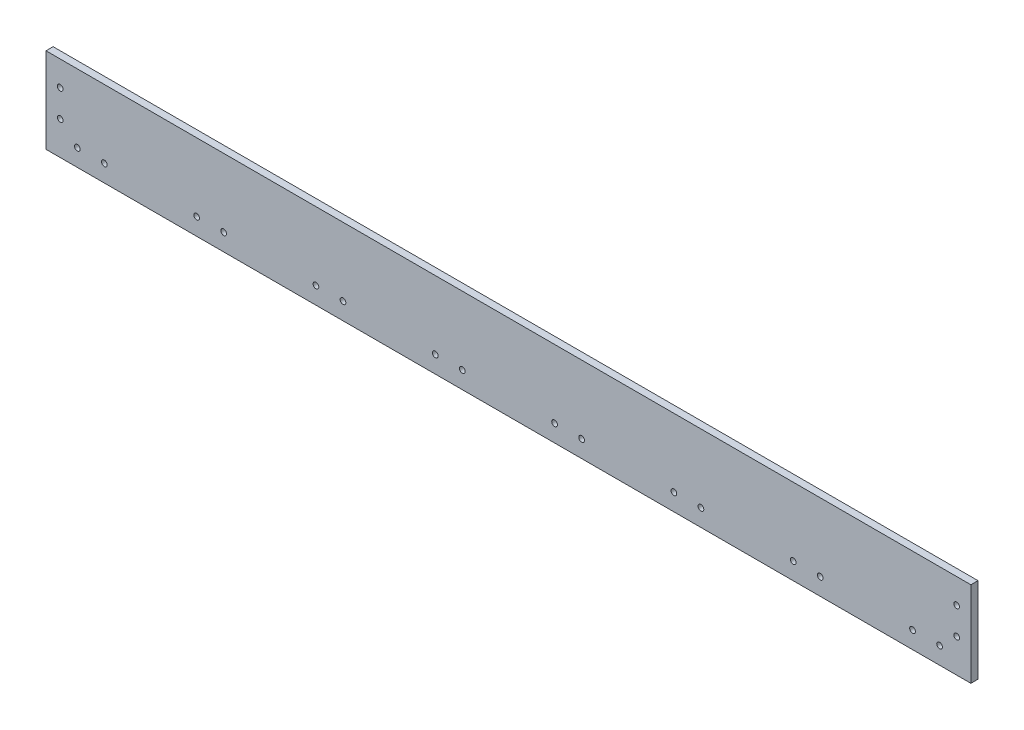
ISO-10303-21;
HEADER;
FILE_DESCRIPTION(('STEP AP214'),'2;1');
FILE_NAME('part.step','',(''),(''),'','','');
FILE_SCHEMA(('AUTOMOTIVE_DESIGN { 1 0 10303 214 1 1 1 1 }'));
ENDSEC;
DATA;
#1=APPLICATION_CONTEXT('core data for automotive mechanical design processes');
#2=APPLICATION_PROTOCOL_DEFINITION('international standard','automotive_design',2000,#1);
#3=PRODUCT_CONTEXT('',#1,'mechanical');
#4=PRODUCT('Part','Part','',(#3));
#5=PRODUCT_RELATED_PRODUCT_CATEGORY('part','',(#4));
#6=PRODUCT_DEFINITION_FORMATION('','',#4);
#7=PRODUCT_DEFINITION_CONTEXT('part definition',#1,'design');
#8=PRODUCT_DEFINITION('design','',#6,#7);
#9=PRODUCT_DEFINITION_SHAPE('','',#8);
#10=(LENGTH_UNIT() NAMED_UNIT(*) SI_UNIT(.MILLI.,.METRE.));
#11=(NAMED_UNIT(*) PLANE_ANGLE_UNIT() SI_UNIT($,.RADIAN.));
#12=(NAMED_UNIT(*) SI_UNIT($,.STERADIAN.) SOLID_ANGLE_UNIT());
#13=UNCERTAINTY_MEASURE_WITH_UNIT(LENGTH_MEASURE(1.E-05),#10,'distance_accuracy_value','');
#14=(GEOMETRIC_REPRESENTATION_CONTEXT(3) GLOBAL_UNCERTAINTY_ASSIGNED_CONTEXT((#13)) GLOBAL_UNIT_ASSIGNED_CONTEXT((#10,
#11,#12)) REPRESENTATION_CONTEXT('',''));
#15=CARTESIAN_POINT('',(0.,0.,0.));
#16=DIRECTION('',(0.,0.,1.));
#17=DIRECTION('',(1.,0.,0.));
#18=AXIS2_PLACEMENT_3D('',#15,#16,#17);
#19=CARTESIAN_POINT('',(0.,0.,6.35));
#20=DIRECTION('',(1.,0.,0.));
#21=DIRECTION('',(0.,1.,0.));
#22=AXIS2_PLACEMENT_3D('',#19,#20,#21);
#23=PLANE('',#22);
#24=DIRECTION('',(0.,-1.,0.));
#25=VECTOR('',#24,1.);
#26=CARTESIAN_POINT('',(0.,0.,0.));
#27=LINE('',#26,#25);
#28=CARTESIAN_POINT('',(0.,76.2,0.));
#29=VERTEX_POINT('',#28);
#30=CARTESIAN_POINT('',(0.,0.,0.));
#31=VERTEX_POINT('',#30);
#32=EDGE_CURVE('E98',#29,#31,#27,.T.);
#33=ORIENTED_EDGE('',*,*,#32,.T.);
#34=DIRECTION('',(0.,0.,-1.));
#35=VECTOR('',#34,1.);
#36=CARTESIAN_POINT('',(0.,0.,6.35));
#37=LINE('',#36,#35);
#38=CARTESIAN_POINT('',(0.,0.,6.35));
#39=VERTEX_POINT('',#38);
#40=EDGE_CURVE('E11',#39,#31,#37,.T.);
#41=ORIENTED_EDGE('',*,*,#40,.F.);
#42=DIRECTION('',(0.,-1.,0.));
#43=VECTOR('',#42,1.);
#44=CARTESIAN_POINT('',(0.,0.,6.35));
#45=LINE('',#44,#43);
#46=CARTESIAN_POINT('',(0.,76.2,6.35));
#47=VERTEX_POINT('',#46);
#48=EDGE_CURVE('E86',#47,#39,#45,.T.);
#49=ORIENTED_EDGE('',*,*,#48,.F.);
#50=DIRECTION('',(0.,0.,-1.));
#51=VECTOR('',#50,1.);
#52=CARTESIAN_POINT('',(0.,76.2,6.35));
#53=LINE('',#52,#51);
#54=EDGE_CURVE('E94',#47,#29,#53,.T.);
#55=ORIENTED_EDGE('',*,*,#54,.T.);
#56=EDGE_LOOP('',(#33,#41,#49,#55));
#57=FACE_BOUND('',#56,.T.);
#58=ADVANCED_FACE('F35',(#57),#23,.F.);
#59=CARTESIAN_POINT('',(0.,0.,6.35));
#60=DIRECTION('',(0.,1.,0.));
#61=DIRECTION('',(0.,0.,1.));
#62=AXIS2_PLACEMENT_3D('',#59,#60,#61);
#63=PLANE('',#62);
#64=DIRECTION('',(1.,0.,0.));
#65=VECTOR('',#64,1.);
#66=CARTESIAN_POINT('',(0.,0.,0.));
#67=LINE('',#66,#65);
#68=CARTESIAN_POINT('',(825.5,0.,0.));
#69=VERTEX_POINT('',#68);
#70=EDGE_CURVE('E90',#31,#69,#67,.T.);
#71=ORIENTED_EDGE('',*,*,#70,.T.);
#72=DIRECTION('',(0.,0.,-1.));
#73=VECTOR('',#72,1.);
#74=CARTESIAN_POINT('',(825.5,0.,6.35));
#75=LINE('',#74,#73);
#76=CARTESIAN_POINT('',(825.5,0.,6.35));
#77=VERTEX_POINT('',#76);
#78=EDGE_CURVE('E43',#77,#69,#75,.T.);
#79=ORIENTED_EDGE('',*,*,#78,.F.);
#80=DIRECTION('',(1.,0.,0.));
#81=VECTOR('',#80,1.);
#82=CARTESIAN_POINT('',(0.,0.,6.35));
#83=LINE('',#82,#81);
#84=EDGE_CURVE('E81',#39,#77,#83,.T.);
#85=ORIENTED_EDGE('',*,*,#84,.F.);
#86=ORIENTED_EDGE('',*,*,#40,.T.);
#87=EDGE_LOOP('',(#71,#79,#85,#86));
#88=FACE_BOUND('',#87,.T.);
#89=ADVANCED_FACE('F89',(#88),#63,.F.);
#90=CARTESIAN_POINT('',(825.5,0.,6.35));
#91=DIRECTION('',(-1.,0.,0.));
#92=DIRECTION('',(0.,0.,1.));
#93=AXIS2_PLACEMENT_3D('',#90,#91,#92);
#94=PLANE('',#93);
#95=DIRECTION('',(0.,1.,0.));
#96=VECTOR('',#95,1.);
#97=CARTESIAN_POINT('',(825.5,0.,0.));
#98=LINE('',#97,#96);
#99=CARTESIAN_POINT('',(825.5,76.2,0.));
#100=VERTEX_POINT('',#99);
#101=EDGE_CURVE('E68',#69,#100,#98,.T.);
#102=ORIENTED_EDGE('',*,*,#101,.T.);
#103=DIRECTION('',(0.,0.,-1.));
#104=VECTOR('',#103,1.);
#105=CARTESIAN_POINT('',(825.5,76.2,6.35));
#106=LINE('',#105,#104);
#107=CARTESIAN_POINT('',(825.5,76.2,6.35));
#108=VERTEX_POINT('',#107);
#109=EDGE_CURVE('E91',#108,#100,#106,.T.);
#110=ORIENTED_EDGE('',*,*,#109,.F.);
#111=DIRECTION('',(0.,1.,0.));
#112=VECTOR('',#111,1.);
#113=CARTESIAN_POINT('',(825.5,0.,6.35));
#114=LINE('',#113,#112);
#115=EDGE_CURVE('E84',#77,#108,#114,.T.);
#116=ORIENTED_EDGE('',*,*,#115,.F.);
#117=ORIENTED_EDGE('',*,*,#78,.T.);
#118=EDGE_LOOP('',(#102,#110,#116,#117));
#119=FACE_BOUND('',#118,.T.);
#120=ADVANCED_FACE('F92',(#119),#94,.F.);
#121=CARTESIAN_POINT('',(0.,76.2,6.35));
#122=DIRECTION('',(0.,-1.,0.));
#123=DIRECTION('',(0.,0.,-1.));
#124=AXIS2_PLACEMENT_3D('',#121,#122,#123);
#125=PLANE('',#124);
#126=DIRECTION('',(-1.,0.,0.));
#127=VECTOR('',#126,1.);
#128=CARTESIAN_POINT('',(0.,76.2,0.));
#129=LINE('',#128,#127);
#130=EDGE_CURVE('E74',#100,#29,#129,.T.);
#131=ORIENTED_EDGE('',*,*,#130,.T.);
#132=ORIENTED_EDGE('',*,*,#54,.F.);
#133=DIRECTION('',(-1.,0.,0.));
#134=VECTOR('',#133,1.);
#135=CARTESIAN_POINT('',(0.,76.2,6.35));
#136=LINE('',#135,#134);
#137=EDGE_CURVE('E51',#108,#47,#136,.T.);
#138=ORIENTED_EDGE('',*,*,#137,.F.);
#139=ORIENTED_EDGE('',*,*,#109,.T.);
#140=EDGE_LOOP('',(#131,#132,#138,#139));
#141=FACE_BOUND('',#140,.T.);
#142=ADVANCED_FACE('F106',(#141),#125,.F.);
#143=CARTESIAN_POINT('',(0.,0.,6.35));
#144=DIRECTION('',(0.,0.,-1.));
#145=DIRECTION('',(-1.,0.,0.));
#146=AXIS2_PLACEMENT_3D('',#143,#144,#145);
#147=PLANE('',#146);
#148=CARTESIAN_POINT('',(773.43,15.24,6.35));
#149=DIRECTION('',(0.,0.,1.));
#150=DIRECTION('',(1.,0.,0.));
#151=AXIS2_PLACEMENT_3D('',#148,#149,#150);
#152=CIRCLE('',#151,2.54000000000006);
#153=CARTESIAN_POINT('',(775.97,15.24,6.35));
#154=VERTEX_POINT('',#153);
#155=EDGE_CURVE('E194',#154,#154,#152,.T.);
#156=ORIENTED_EDGE('',*,*,#155,.F.);
#157=EDGE_LOOP('',(#156));
#158=FACE_BOUND('',#157,.T.);
#159=CARTESIAN_POINT('',(797.56,15.24,6.35));
#160=DIRECTION('',(0.,0.,1.));
#161=DIRECTION('',(1.,0.,0.));
#162=AXIS2_PLACEMENT_3D('',#159,#160,#161);
#163=CIRCLE('',#162,2.54000000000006);
#164=CARTESIAN_POINT('',(800.1,15.24,6.35));
#165=VERTEX_POINT('',#164);
#166=EDGE_CURVE('E193',#165,#165,#163,.T.);
#167=ORIENTED_EDGE('',*,*,#166,.F.);
#168=EDGE_LOOP('',(#167));
#169=FACE_BOUND('',#168,.T.);
#170=CARTESIAN_POINT('',(666.931428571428,15.24,6.35));
#171=DIRECTION('',(0.,0.,1.));
#172=DIRECTION('',(1.,0.,0.));
#173=AXIS2_PLACEMENT_3D('',#170,#171,#172);
#174=CIRCLE('',#173,2.54000000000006);
#175=CARTESIAN_POINT('',(669.471428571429,15.24,6.35));
#176=VERTEX_POINT('',#175);
#177=EDGE_CURVE('E200',#176,#176,#174,.T.);
#178=ORIENTED_EDGE('',*,*,#177,.F.);
#179=EDGE_LOOP('',(#178));
#180=FACE_BOUND('',#179,.T.);
#181=CARTESIAN_POINT('',(691.061428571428,15.24,6.35));
#182=DIRECTION('',(0.,0.,1.));
#183=DIRECTION('',(1.,0.,0.));
#184=AXIS2_PLACEMENT_3D('',#181,#182,#183);
#185=CIRCLE('',#184,2.54000000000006);
#186=CARTESIAN_POINT('',(693.601428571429,15.24,6.35));
#187=VERTEX_POINT('',#186);
#188=EDGE_CURVE('E206',#187,#187,#185,.T.);
#189=ORIENTED_EDGE('',*,*,#188,.F.);
#190=EDGE_LOOP('',(#189));
#191=FACE_BOUND('',#190,.T.);
#192=CARTESIAN_POINT('',(560.432857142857,15.24,6.35));
#193=DIRECTION('',(0.,0.,1.));
#194=DIRECTION('',(1.,0.,0.));
#195=AXIS2_PLACEMENT_3D('',#192,#193,#194);
#196=CIRCLE('',#195,2.54000000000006);
#197=CARTESIAN_POINT('',(562.972857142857,15.24,6.35));
#198=VERTEX_POINT('',#197);
#199=EDGE_CURVE('E212',#198,#198,#196,.T.);
#200=ORIENTED_EDGE('',*,*,#199,.F.);
#201=EDGE_LOOP('',(#200));
#202=FACE_BOUND('',#201,.T.);
#203=CARTESIAN_POINT('',(584.562857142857,15.24,6.35));
#204=DIRECTION('',(0.,0.,1.));
#205=DIRECTION('',(1.,0.,0.));
#206=AXIS2_PLACEMENT_3D('',#203,#204,#205);
#207=CIRCLE('',#206,2.54000000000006);
#208=CARTESIAN_POINT('',(587.102857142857,15.24,6.35));
#209=VERTEX_POINT('',#208);
#210=EDGE_CURVE('E218',#209,#209,#207,.T.);
#211=ORIENTED_EDGE('',*,*,#210,.F.);
#212=EDGE_LOOP('',(#211));
#213=FACE_BOUND('',#212,.T.);
#214=CARTESIAN_POINT('',(453.934285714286,15.24,6.35));
#215=DIRECTION('',(0.,0.,1.));
#216=DIRECTION('',(1.,0.,0.));
#217=AXIS2_PLACEMENT_3D('',#214,#215,#216);
#218=CIRCLE('',#217,2.54000000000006);
#219=CARTESIAN_POINT('',(456.474285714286,15.24,6.35));
#220=VERTEX_POINT('',#219);
#221=EDGE_CURVE('E224',#220,#220,#218,.T.);
#222=ORIENTED_EDGE('',*,*,#221,.F.);
#223=EDGE_LOOP('',(#222));
#224=FACE_BOUND('',#223,.T.);
#225=CARTESIAN_POINT('',(371.565714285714,15.24,6.35));
#226=DIRECTION('',(0.,0.,1.));
#227=DIRECTION('',(1.,0.,0.));
#228=AXIS2_PLACEMENT_3D('',#225,#226,#227);
#229=CIRCLE('',#228,2.54000000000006);
#230=CARTESIAN_POINT('',(374.105714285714,15.24,6.35));
#231=VERTEX_POINT('',#230);
#232=EDGE_CURVE('E158',#231,#231,#229,.T.);
#233=ORIENTED_EDGE('',*,*,#232,.F.);
#234=EDGE_LOOP('',(#233));
#235=FACE_BOUND('',#234,.T.);
#236=CARTESIAN_POINT('',(347.435714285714,15.24,6.35));
#237=DIRECTION('',(0.,0.,1.));
#238=DIRECTION('',(1.,0.,0.));
#239=AXIS2_PLACEMENT_3D('',#236,#237,#238);
#240=CIRCLE('',#239,2.54000000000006);
#241=CARTESIAN_POINT('',(349.975714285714,15.24,6.35));
#242=VERTEX_POINT('',#241);
#243=EDGE_CURVE('E165',#242,#242,#240,.T.);
#244=ORIENTED_EDGE('',*,*,#243,.F.);
#245=EDGE_LOOP('',(#244));
#246=FACE_BOUND('',#245,.T.);
#247=CARTESIAN_POINT('',(478.064285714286,15.24,6.35));
#248=DIRECTION('',(0.,0.,1.));
#249=DIRECTION('',(1.,0.,0.));
#250=AXIS2_PLACEMENT_3D('',#247,#248,#249);
#251=CIRCLE('',#250,2.54000000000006);
#252=CARTESIAN_POINT('',(480.604285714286,15.24,6.35));
#253=VERTEX_POINT('',#252);
#254=EDGE_CURVE('E166',#253,#253,#251,.T.);
#255=ORIENTED_EDGE('',*,*,#254,.F.);
#256=EDGE_LOOP('',(#255));
#257=FACE_BOUND('',#256,.T.);
#258=CARTESIAN_POINT('',(240.937142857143,15.24,6.35));
#259=DIRECTION('',(0.,0.,1.));
#260=DIRECTION('',(1.,0.,0.));
#261=AXIS2_PLACEMENT_3D('',#258,#259,#260);
#262=CIRCLE('',#261,2.54000000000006);
#263=CARTESIAN_POINT('',(243.477142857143,15.24,6.35));
#264=VERTEX_POINT('',#263);
#265=EDGE_CURVE('E157',#264,#264,#262,.T.);
#266=ORIENTED_EDGE('',*,*,#265,.F.);
#267=EDGE_LOOP('',(#266));
#268=FACE_BOUND('',#267,.T.);
#269=CARTESIAN_POINT('',(265.067142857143,15.24,6.35));
#270=DIRECTION('',(0.,0.,1.));
#271=DIRECTION('',(1.,0.,0.));
#272=AXIS2_PLACEMENT_3D('',#269,#270,#271);
#273=CIRCLE('',#272,2.54000000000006);
#274=CARTESIAN_POINT('',(267.607142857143,15.24,6.35));
#275=VERTEX_POINT('',#274);
#276=EDGE_CURVE('E177',#275,#275,#273,.T.);
#277=ORIENTED_EDGE('',*,*,#276,.F.);
#278=EDGE_LOOP('',(#277));
#279=FACE_BOUND('',#278,.T.);
#280=CARTESIAN_POINT('',(134.438571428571,15.24,6.35));
#281=DIRECTION('',(0.,0.,1.));
#282=DIRECTION('',(1.,0.,0.));
#283=AXIS2_PLACEMENT_3D('',#280,#281,#282);
#284=CIRCLE('',#283,2.54000000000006);
#285=CARTESIAN_POINT('',(136.978571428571,15.24,6.35));
#286=VERTEX_POINT('',#285);
#287=EDGE_CURVE('E183',#286,#286,#284,.T.);
#288=ORIENTED_EDGE('',*,*,#287,.F.);
#289=EDGE_LOOP('',(#288));
#290=FACE_BOUND('',#289,.T.);
#291=CARTESIAN_POINT('',(158.568571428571,15.24,6.35));
#292=DIRECTION('',(0.,0.,1.));
#293=DIRECTION('',(1.,0.,0.));
#294=AXIS2_PLACEMENT_3D('',#291,#292,#293);
#295=CIRCLE('',#294,2.54000000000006);
#296=CARTESIAN_POINT('',(161.108571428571,15.24,6.35));
#297=VERTEX_POINT('',#296);
#298=EDGE_CURVE('E150',#297,#297,#295,.T.);
#299=ORIENTED_EDGE('',*,*,#298,.F.);
#300=EDGE_LOOP('',(#299));
#301=FACE_BOUND('',#300,.T.);
#302=CARTESIAN_POINT('',(12.7,53.975,6.35));
#303=DIRECTION('',(0.,0.,1.));
#304=DIRECTION('',(1.,0.,0.));
#305=AXIS2_PLACEMENT_3D('',#302,#303,#304);
#306=CIRCLE('',#305,2.54);
#307=CARTESIAN_POINT('',(15.24,53.975,6.35));
#308=VERTEX_POINT('',#307);
#309=EDGE_CURVE('E141',#308,#308,#306,.T.);
#310=ORIENTED_EDGE('',*,*,#309,.F.);
#311=EDGE_LOOP('',(#310));
#312=FACE_BOUND('',#311,.T.);
#313=CARTESIAN_POINT('',(812.8,29.8450000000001,6.35));
#314=DIRECTION('',(0.,0.,1.));
#315=DIRECTION('',(-1.,0.,0.));
#316=AXIS2_PLACEMENT_3D('',#313,#314,#315);
#317=CIRCLE('',#316,2.54000000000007);
#318=CARTESIAN_POINT('',(810.26,29.8450000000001,6.35));
#319=VERTEX_POINT('',#318);
#320=EDGE_CURVE('E133',#319,#319,#317,.T.);
#321=ORIENTED_EDGE('',*,*,#320,.F.);
#322=EDGE_LOOP('',(#321));
#323=FACE_BOUND('',#322,.T.);
#324=CARTESIAN_POINT('',(812.8,53.9750000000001,6.35));
#325=DIRECTION('',(0.,0.,1.));
#326=DIRECTION('',(-1.,0.,0.));
#327=AXIS2_PLACEMENT_3D('',#324,#325,#326);
#328=CIRCLE('',#327,2.54000000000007);
#329=CARTESIAN_POINT('',(810.26,53.9750000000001,6.35));
#330=VERTEX_POINT('',#329);
#331=EDGE_CURVE('E134',#330,#330,#328,.T.);
#332=ORIENTED_EDGE('',*,*,#331,.F.);
#333=EDGE_LOOP('',(#332));
#334=FACE_BOUND('',#333,.T.);
#335=CARTESIAN_POINT('',(12.7,29.845,6.35));
#336=DIRECTION('',(0.,0.,1.));
#337=DIRECTION('',(1.,0.,0.));
#338=AXIS2_PLACEMENT_3D('',#335,#336,#337);
#339=CIRCLE('',#338,2.54);
#340=CARTESIAN_POINT('',(15.24,29.845,6.35));
#341=VERTEX_POINT('',#340);
#342=EDGE_CURVE('E126',#341,#341,#339,.T.);
#343=ORIENTED_EDGE('',*,*,#342,.F.);
#344=EDGE_LOOP('',(#343));
#345=FACE_BOUND('',#344,.T.);
#346=CARTESIAN_POINT('',(27.94,15.24,6.35));
#347=DIRECTION('',(0.,0.,1.));
#348=DIRECTION('',(1.,0.,0.));
#349=AXIS2_PLACEMENT_3D('',#346,#347,#348);
#350=CIRCLE('',#349,2.54000000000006);
#351=CARTESIAN_POINT('',(30.48,15.24,6.35));
#352=VERTEX_POINT('',#351);
#353=EDGE_CURVE('E117',#352,#352,#350,.T.);
#354=ORIENTED_EDGE('',*,*,#353,.F.);
#355=EDGE_LOOP('',(#354));
#356=FACE_BOUND('',#355,.T.);
#357=CARTESIAN_POINT('',(52.07,15.24,6.35));
#358=DIRECTION('',(0.,0.,1.));
#359=DIRECTION('',(1.,0.,0.));
#360=AXIS2_PLACEMENT_3D('',#357,#358,#359);
#361=CIRCLE('',#360,2.54000000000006);
#362=CARTESIAN_POINT('',(54.6100000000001,15.24,6.35));
#363=VERTEX_POINT('',#362);
#364=EDGE_CURVE('E114',#363,#363,#361,.T.);
#365=ORIENTED_EDGE('',*,*,#364,.F.);
#366=EDGE_LOOP('',(#365));
#367=FACE_BOUND('',#366,.T.);
#368=ORIENTED_EDGE('',*,*,#48,.T.);
#369=ORIENTED_EDGE('',*,*,#84,.T.);
#370=ORIENTED_EDGE('',*,*,#115,.T.);
#371=ORIENTED_EDGE('',*,*,#137,.T.);
#372=EDGE_LOOP('',(#368,#369,#370,#371));
#373=FACE_BOUND('',#372,.T.);
#374=ADVANCED_FACE('F82',(#158,#169,#180,#191,#202,#213,#224,#235,#246,#257,#268,#279,#290,#301,
#312,#323,#334,#345,#356,#367,#373),#147,.F.);
#375=CARTESIAN_POINT('',(0.,0.,0.));
#376=DIRECTION('',(0.,0.,-1.));
#377=DIRECTION('',(-1.,0.,0.));
#378=AXIS2_PLACEMENT_3D('',#375,#376,#377);
#379=PLANE('',#378);
#380=CARTESIAN_POINT('',(773.43,15.24,0.));
#381=DIRECTION('',(0.,0.,-1.));
#382=DIRECTION('',(-1.,0.,0.));
#383=AXIS2_PLACEMENT_3D('',#380,#381,#382);
#384=CIRCLE('',#383,2.54000000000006);
#385=CARTESIAN_POINT('',(770.89,15.24,0.));
#386=VERTEX_POINT('',#385);
#387=EDGE_CURVE('E190',#386,#386,#384,.F.);
#388=ORIENTED_EDGE('',*,*,#387,.T.);
#389=EDGE_LOOP('',(#388));
#390=FACE_BOUND('',#389,.T.);
#391=CARTESIAN_POINT('',(797.56,15.24,0.));
#392=DIRECTION('',(0.,0.,-1.));
#393=DIRECTION('',(-1.,0.,0.));
#394=AXIS2_PLACEMENT_3D('',#391,#392,#393);
#395=CIRCLE('',#394,2.54000000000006);
#396=CARTESIAN_POINT('',(795.02,15.24,0.));
#397=VERTEX_POINT('',#396);
#398=EDGE_CURVE('E197',#397,#397,#395,.F.);
#399=ORIENTED_EDGE('',*,*,#398,.T.);
#400=EDGE_LOOP('',(#399));
#401=FACE_BOUND('',#400,.T.);
#402=CARTESIAN_POINT('',(666.931428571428,15.24,0.));
#403=DIRECTION('',(0.,0.,-1.));
#404=DIRECTION('',(-1.,0.,0.));
#405=AXIS2_PLACEMENT_3D('',#402,#403,#404);
#406=CIRCLE('',#405,2.54000000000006);
#407=CARTESIAN_POINT('',(664.391428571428,15.24,0.));
#408=VERTEX_POINT('',#407);
#409=EDGE_CURVE('E203',#408,#408,#406,.F.);
#410=ORIENTED_EDGE('',*,*,#409,.T.);
#411=EDGE_LOOP('',(#410));
#412=FACE_BOUND('',#411,.T.);
#413=CARTESIAN_POINT('',(691.061428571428,15.24,0.));
#414=DIRECTION('',(0.,0.,-1.));
#415=DIRECTION('',(-1.,0.,0.));
#416=AXIS2_PLACEMENT_3D('',#413,#414,#415);
#417=CIRCLE('',#416,2.54000000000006);
#418=CARTESIAN_POINT('',(688.521428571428,15.24,0.));
#419=VERTEX_POINT('',#418);
#420=EDGE_CURVE('E209',#419,#419,#417,.F.);
#421=ORIENTED_EDGE('',*,*,#420,.T.);
#422=EDGE_LOOP('',(#421));
#423=FACE_BOUND('',#422,.T.);
#424=CARTESIAN_POINT('',(560.432857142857,15.24,0.));
#425=DIRECTION('',(0.,0.,-1.));
#426=DIRECTION('',(-1.,0.,0.));
#427=AXIS2_PLACEMENT_3D('',#424,#425,#426);
#428=CIRCLE('',#427,2.54000000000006);
#429=CARTESIAN_POINT('',(557.892857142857,15.24,0.));
#430=VERTEX_POINT('',#429);
#431=EDGE_CURVE('E215',#430,#430,#428,.F.);
#432=ORIENTED_EDGE('',*,*,#431,.T.);
#433=EDGE_LOOP('',(#432));
#434=FACE_BOUND('',#433,.T.);
#435=CARTESIAN_POINT('',(584.562857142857,15.24,0.));
#436=DIRECTION('',(0.,0.,-1.));
#437=DIRECTION('',(-1.,0.,0.));
#438=AXIS2_PLACEMENT_3D('',#435,#436,#437);
#439=CIRCLE('',#438,2.54000000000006);
#440=CARTESIAN_POINT('',(582.022857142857,15.24,0.));
#441=VERTEX_POINT('',#440);
#442=EDGE_CURVE('E221',#441,#441,#439,.F.);
#443=ORIENTED_EDGE('',*,*,#442,.T.);
#444=EDGE_LOOP('',(#443));
#445=FACE_BOUND('',#444,.T.);
#446=CARTESIAN_POINT('',(453.934285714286,15.24,0.));
#447=DIRECTION('',(0.,0.,-1.));
#448=DIRECTION('',(-1.,0.,0.));
#449=AXIS2_PLACEMENT_3D('',#446,#447,#448);
#450=CIRCLE('',#449,2.54000000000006);
#451=CARTESIAN_POINT('',(456.474285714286,15.24,0.));
#452=VERTEX_POINT('',#451);
#453=EDGE_CURVE('E169',#452,#452,#450,.F.);
#454=ORIENTED_EDGE('',*,*,#453,.T.);
#455=EDGE_LOOP('',(#454));
#456=FACE_BOUND('',#455,.T.);
#457=CARTESIAN_POINT('',(371.565714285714,15.24,0.));
#458=DIRECTION('',(0.,0.,-1.));
#459=DIRECTION('',(-1.,0.,0.));
#460=AXIS2_PLACEMENT_3D('',#457,#458,#459);
#461=CIRCLE('',#460,2.54000000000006);
#462=CARTESIAN_POINT('',(374.105714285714,15.24,0.));
#463=VERTEX_POINT('',#462);
#464=EDGE_CURVE('E154',#463,#463,#461,.F.);
#465=ORIENTED_EDGE('',*,*,#464,.T.);
#466=EDGE_LOOP('',(#465));
#467=FACE_BOUND('',#466,.T.);
#468=CARTESIAN_POINT('',(347.435714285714,15.24,0.));
#469=DIRECTION('',(0.,0.,-1.));
#470=DIRECTION('',(-1.,0.,0.));
#471=AXIS2_PLACEMENT_3D('',#468,#469,#470);
#472=CIRCLE('',#471,2.54000000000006);
#473=CARTESIAN_POINT('',(349.975714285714,15.24,0.));
#474=VERTEX_POINT('',#473);
#475=EDGE_CURVE('E161',#474,#474,#472,.F.);
#476=ORIENTED_EDGE('',*,*,#475,.T.);
#477=EDGE_LOOP('',(#476));
#478=FACE_BOUND('',#477,.T.);
#479=CARTESIAN_POINT('',(478.064285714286,15.24,0.));
#480=DIRECTION('',(0.,0.,-1.));
#481=DIRECTION('',(-1.,0.,0.));
#482=AXIS2_PLACEMENT_3D('',#479,#480,#481);
#483=CIRCLE('',#482,2.54000000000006);
#484=CARTESIAN_POINT('',(480.604285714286,15.24,0.));
#485=VERTEX_POINT('',#484);
#486=EDGE_CURVE('E162',#485,#485,#483,.F.);
#487=ORIENTED_EDGE('',*,*,#486,.T.);
#488=EDGE_LOOP('',(#487));
#489=FACE_BOUND('',#488,.T.);
#490=CARTESIAN_POINT('',(240.937142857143,15.24,0.));
#491=DIRECTION('',(0.,0.,-1.));
#492=DIRECTION('',(-1.,0.,0.));
#493=AXIS2_PLACEMENT_3D('',#490,#491,#492);
#494=CIRCLE('',#493,2.54000000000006);
#495=CARTESIAN_POINT('',(238.397142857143,15.24,0.));
#496=VERTEX_POINT('',#495);
#497=EDGE_CURVE('E174',#496,#496,#494,.F.);
#498=ORIENTED_EDGE('',*,*,#497,.T.);
#499=EDGE_LOOP('',(#498));
#500=FACE_BOUND('',#499,.T.);
#501=CARTESIAN_POINT('',(265.067142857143,15.24,0.));
#502=DIRECTION('',(0.,0.,-1.));
#503=DIRECTION('',(-1.,0.,0.));
#504=AXIS2_PLACEMENT_3D('',#501,#502,#503);
#505=CIRCLE('',#504,2.54000000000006);
#506=CARTESIAN_POINT('',(262.527142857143,15.24,0.));
#507=VERTEX_POINT('',#506);
#508=EDGE_CURVE('E180',#507,#507,#505,.F.);
#509=ORIENTED_EDGE('',*,*,#508,.T.);
#510=EDGE_LOOP('',(#509));
#511=FACE_BOUND('',#510,.T.);
#512=CARTESIAN_POINT('',(134.438571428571,15.24,0.));
#513=DIRECTION('',(0.,0.,-1.));
#514=DIRECTION('',(-1.,0.,0.));
#515=AXIS2_PLACEMENT_3D('',#512,#513,#514);
#516=CIRCLE('',#515,2.54000000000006);
#517=CARTESIAN_POINT('',(131.898571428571,15.24,0.));
#518=VERTEX_POINT('',#517);
#519=EDGE_CURVE('E153',#518,#518,#516,.F.);
#520=ORIENTED_EDGE('',*,*,#519,.T.);
#521=EDGE_LOOP('',(#520));
#522=FACE_BOUND('',#521,.T.);
#523=CARTESIAN_POINT('',(158.568571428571,15.24,0.));
#524=DIRECTION('',(0.,0.,-1.));
#525=DIRECTION('',(-1.,0.,0.));
#526=AXIS2_PLACEMENT_3D('',#523,#524,#525);
#527=CIRCLE('',#526,2.54000000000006);
#528=CARTESIAN_POINT('',(156.028571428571,15.24,0.));
#529=VERTEX_POINT('',#528);
#530=EDGE_CURVE('E137',#529,#529,#527,.F.);
#531=ORIENTED_EDGE('',*,*,#530,.T.);
#532=EDGE_LOOP('',(#531));
#533=FACE_BOUND('',#532,.T.);
#534=CARTESIAN_POINT('',(12.7,53.975,0.));
#535=DIRECTION('',(0.,0.,-1.));
#536=DIRECTION('',(-1.,0.,0.));
#537=AXIS2_PLACEMENT_3D('',#534,#535,#536);
#538=CIRCLE('',#537,2.54);
#539=CARTESIAN_POINT('',(10.16,53.975,0.));
#540=VERTEX_POINT('',#539);
#541=EDGE_CURVE('E129',#540,#540,#538,.F.);
#542=ORIENTED_EDGE('',*,*,#541,.T.);
#543=EDGE_LOOP('',(#542));
#544=FACE_BOUND('',#543,.T.);
#545=CARTESIAN_POINT('',(812.8,29.8450000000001,0.));
#546=DIRECTION('',(0.,0.,-1.));
#547=DIRECTION('',(-1.,0.,0.));
#548=AXIS2_PLACEMENT_3D('',#545,#546,#547);
#549=CIRCLE('',#548,2.54000000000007);
#550=CARTESIAN_POINT('',(810.26,29.8450000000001,0.));
#551=VERTEX_POINT('',#550);
#552=EDGE_CURVE('E138',#551,#551,#549,.F.);
#553=ORIENTED_EDGE('',*,*,#552,.T.);
#554=EDGE_LOOP('',(#553));
#555=FACE_BOUND('',#554,.T.);
#556=CARTESIAN_POINT('',(812.8,53.9750000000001,0.));
#557=DIRECTION('',(0.,0.,-1.));
#558=DIRECTION('',(-1.,0.,0.));
#559=AXIS2_PLACEMENT_3D('',#556,#557,#558);
#560=CIRCLE('',#559,2.54000000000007);
#561=CARTESIAN_POINT('',(810.26,53.9750000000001,0.));
#562=VERTEX_POINT('',#561);
#563=EDGE_CURVE('E130',#562,#562,#560,.F.);
#564=ORIENTED_EDGE('',*,*,#563,.T.);
#565=EDGE_LOOP('',(#564));
#566=FACE_BOUND('',#565,.T.);
#567=CARTESIAN_POINT('',(12.7,29.845,0.));
#568=DIRECTION('',(0.,0.,-1.));
#569=DIRECTION('',(-1.,0.,0.));
#570=AXIS2_PLACEMENT_3D('',#567,#568,#569);
#571=CIRCLE('',#570,2.54);
#572=CARTESIAN_POINT('',(10.16,29.845,0.));
#573=VERTEX_POINT('',#572);
#574=EDGE_CURVE('E123',#573,#573,#571,.F.);
#575=ORIENTED_EDGE('',*,*,#574,.T.);
#576=EDGE_LOOP('',(#575));
#577=FACE_BOUND('',#576,.T.);
#578=CARTESIAN_POINT('',(27.94,15.24,0.));
#579=DIRECTION('',(0.,0.,-1.));
#580=DIRECTION('',(-1.,0.,0.));
#581=AXIS2_PLACEMENT_3D('',#578,#579,#580);
#582=CIRCLE('',#581,2.54000000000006);
#583=CARTESIAN_POINT('',(25.3999999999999,15.24,0.));
#584=VERTEX_POINT('',#583);
#585=EDGE_CURVE('E120',#584,#584,#582,.F.);
#586=ORIENTED_EDGE('',*,*,#585,.T.);
#587=EDGE_LOOP('',(#586));
#588=FACE_BOUND('',#587,.T.);
#589=CARTESIAN_POINT('',(52.07,15.24,0.));
#590=DIRECTION('',(0.,0.,-1.));
#591=DIRECTION('',(-1.,0.,0.));
#592=AXIS2_PLACEMENT_3D('',#589,#590,#591);
#593=CIRCLE('',#592,2.54000000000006);
#594=CARTESIAN_POINT('',(49.5299999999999,15.24,0.));
#595=VERTEX_POINT('',#594);
#596=EDGE_CURVE('E101',#595,#595,#593,.F.);
#597=ORIENTED_EDGE('',*,*,#596,.T.);
#598=EDGE_LOOP('',(#597));
#599=FACE_BOUND('',#598,.T.);
#600=ORIENTED_EDGE('',*,*,#32,.F.);
#601=ORIENTED_EDGE('',*,*,#130,.F.);
#602=ORIENTED_EDGE('',*,*,#101,.F.);
#603=ORIENTED_EDGE('',*,*,#70,.F.);
#604=EDGE_LOOP('',(#600,#601,#602,#603));
#605=FACE_BOUND('',#604,.T.);
#606=ADVANCED_FACE('F109',(#390,#401,#412,#423,#434,#445,#456,#467,#478,#489,#500,#511,#522,
#533,#544,#555,#566,#577,#588,#599,#605),#379,.T.);
#607=CARTESIAN_POINT('',(52.07,15.24,-7.1842048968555));
#608=DIRECTION('',(0.,0.,1.));
#609=DIRECTION('',(1.,0.,0.));
#610=AXIS2_PLACEMENT_3D('',#607,#608,#609);
#611=CYLINDRICAL_SURFACE('',#610,2.54000000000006);
#612=ORIENTED_EDGE('',*,*,#364,.T.);
#613=EDGE_LOOP('',(#612));
#614=FACE_BOUND('',#613,.T.);
#615=ORIENTED_EDGE('',*,*,#596,.F.);
#616=EDGE_LOOP('',(#615));
#617=FACE_BOUND('',#616,.T.);
#618=ADVANCED_FACE('F265',(#614,#617),#611,.F.);
#619=CARTESIAN_POINT('',(27.94,15.24,-7.1842048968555));
#620=DIRECTION('',(0.,0.,1.));
#621=DIRECTION('',(1.,0.,0.));
#622=AXIS2_PLACEMENT_3D('',#619,#620,#621);
#623=CYLINDRICAL_SURFACE('',#622,2.54000000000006);
#624=ORIENTED_EDGE('',*,*,#353,.T.);
#625=EDGE_LOOP('',(#624));
#626=FACE_BOUND('',#625,.T.);
#627=ORIENTED_EDGE('',*,*,#585,.F.);
#628=EDGE_LOOP('',(#627));
#629=FACE_BOUND('',#628,.T.);
#630=ADVANCED_FACE('F268',(#626,#629),#623,.F.);
#631=CARTESIAN_POINT('',(12.7,29.845,-7.18420489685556));
#632=DIRECTION('',(0.,0.,1.));
#633=DIRECTION('',(1.,0.,0.));
#634=AXIS2_PLACEMENT_3D('',#631,#632,#633);
#635=CYLINDRICAL_SURFACE('',#634,2.54);
#636=ORIENTED_EDGE('',*,*,#342,.T.);
#637=EDGE_LOOP('',(#636));
#638=FACE_BOUND('',#637,.T.);
#639=ORIENTED_EDGE('',*,*,#574,.F.);
#640=EDGE_LOOP('',(#639));
#641=FACE_BOUND('',#640,.T.);
#642=ADVANCED_FACE('F461',(#638,#641),#635,.F.);
#643=CARTESIAN_POINT('',(812.8,53.9750000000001,-7.18420489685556));
#644=DIRECTION('',(0.,0.,1.));
#645=DIRECTION('',(1.,0.,0.));
#646=AXIS2_PLACEMENT_3D('',#643,#644,#645);
#647=CYLINDRICAL_SURFACE('',#646,2.54000000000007);
#648=ORIENTED_EDGE('',*,*,#331,.T.);
#649=EDGE_LOOP('',(#648));
#650=FACE_BOUND('',#649,.T.);
#651=ORIENTED_EDGE('',*,*,#563,.F.);
#652=EDGE_LOOP('',(#651));
#653=FACE_BOUND('',#652,.T.);
#654=ADVANCED_FACE('F457',(#650,#653),#647,.F.);
#655=CARTESIAN_POINT('',(812.8,29.8450000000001,-7.18420489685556));
#656=DIRECTION('',(0.,0.,1.));
#657=DIRECTION('',(1.,0.,0.));
#658=AXIS2_PLACEMENT_3D('',#655,#656,#657);
#659=CYLINDRICAL_SURFACE('',#658,2.54000000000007);
#660=ORIENTED_EDGE('',*,*,#320,.T.);
#661=EDGE_LOOP('',(#660));
#662=FACE_BOUND('',#661,.T.);
#663=ORIENTED_EDGE('',*,*,#552,.F.);
#664=EDGE_LOOP('',(#663));
#665=FACE_BOUND('',#664,.T.);
#666=ADVANCED_FACE('F453',(#662,#665),#659,.F.);
#667=CARTESIAN_POINT('',(12.7,53.975,-7.18420489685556));
#668=DIRECTION('',(0.,0.,1.));
#669=DIRECTION('',(1.,0.,0.));
#670=AXIS2_PLACEMENT_3D('',#667,#668,#669);
#671=CYLINDRICAL_SURFACE('',#670,2.54);
#672=ORIENTED_EDGE('',*,*,#309,.T.);
#673=EDGE_LOOP('',(#672));
#674=FACE_BOUND('',#673,.T.);
#675=ORIENTED_EDGE('',*,*,#541,.F.);
#676=EDGE_LOOP('',(#675));
#677=FACE_BOUND('',#676,.T.);
#678=ADVANCED_FACE('F303',(#674,#677),#671,.F.);
#679=CARTESIAN_POINT('',(158.568571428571,15.24,-7.18420489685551));
#680=DIRECTION('',(0.,0.,1.));
#681=DIRECTION('',(1.,0.,0.));
#682=AXIS2_PLACEMENT_3D('',#679,#680,#681);
#683=CYLINDRICAL_SURFACE('',#682,2.54000000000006);
#684=ORIENTED_EDGE('',*,*,#298,.T.);
#685=EDGE_LOOP('',(#684));
#686=FACE_BOUND('',#685,.T.);
#687=ORIENTED_EDGE('',*,*,#530,.F.);
#688=EDGE_LOOP('',(#687));
#689=FACE_BOUND('',#688,.T.);
#690=ADVANCED_FACE('F313',(#686,#689),#683,.F.);
#691=CARTESIAN_POINT('',(134.438571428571,15.24,-7.18420489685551));
#692=DIRECTION('',(0.,0.,1.));
#693=DIRECTION('',(1.,0.,0.));
#694=AXIS2_PLACEMENT_3D('',#691,#692,#693);
#695=CYLINDRICAL_SURFACE('',#694,2.54000000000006);
#696=ORIENTED_EDGE('',*,*,#287,.T.);
#697=EDGE_LOOP('',(#696));
#698=FACE_BOUND('',#697,.T.);
#699=ORIENTED_EDGE('',*,*,#519,.F.);
#700=EDGE_LOOP('',(#699));
#701=FACE_BOUND('',#700,.T.);
#702=ADVANCED_FACE('F318',(#698,#701),#695,.F.);
#703=CARTESIAN_POINT('',(265.067142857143,15.24,-7.18420489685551));
#704=DIRECTION('',(0.,0.,1.));
#705=DIRECTION('',(1.,0.,0.));
#706=AXIS2_PLACEMENT_3D('',#703,#704,#705);
#707=CYLINDRICAL_SURFACE('',#706,2.54000000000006);
#708=ORIENTED_EDGE('',*,*,#276,.T.);
#709=EDGE_LOOP('',(#708));
#710=FACE_BOUND('',#709,.T.);
#711=ORIENTED_EDGE('',*,*,#508,.F.);
#712=EDGE_LOOP('',(#711));
#713=FACE_BOUND('',#712,.T.);
#714=ADVANCED_FACE('F328',(#710,#713),#707,.F.);
#715=CARTESIAN_POINT('',(240.937142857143,15.24,-7.18420489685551));
#716=DIRECTION('',(0.,0.,1.));
#717=DIRECTION('',(1.,0.,0.));
#718=AXIS2_PLACEMENT_3D('',#715,#716,#717);
#719=CYLINDRICAL_SURFACE('',#718,2.54000000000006);
#720=ORIENTED_EDGE('',*,*,#265,.T.);
#721=EDGE_LOOP('',(#720));
#722=FACE_BOUND('',#721,.T.);
#723=ORIENTED_EDGE('',*,*,#497,.F.);
#724=EDGE_LOOP('',(#723));
#725=FACE_BOUND('',#724,.T.);
#726=ADVANCED_FACE('F338',(#722,#725),#719,.F.);
#727=CARTESIAN_POINT('',(478.064285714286,15.24,-7.18420489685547));
#728=DIRECTION('',(0.,0.,1.));
#729=DIRECTION('',(1.,0.,0.));
#730=AXIS2_PLACEMENT_3D('',#727,#728,#729);
#731=CYLINDRICAL_SURFACE('',#730,2.54000000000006);
#732=CARTESIAN_POINT('',(480.604285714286,15.24,6.35));
#733=CARTESIAN_POINT('',(480.604285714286,15.24,6.28385416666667));
#734=CARTESIAN_POINT('',(480.604285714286,15.24,6.21770833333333));
#735=CARTESIAN_POINT('',(480.604285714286,15.24,6.08541666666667));
#736=CARTESIAN_POINT('',(480.604285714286,15.24,6.01927083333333));
#737=CARTESIAN_POINT('',(480.604285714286,15.24,5.88697916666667));
#738=CARTESIAN_POINT('',(480.604285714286,15.24,5.82083333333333));
#739=CARTESIAN_POINT('',(480.604285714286,15.24,5.68854166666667));
#740=CARTESIAN_POINT('',(480.604285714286,15.24,5.62239583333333));
#741=CARTESIAN_POINT('',(480.604285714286,15.24,5.49010416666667));
#742=CARTESIAN_POINT('',(480.604285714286,15.24,5.42395833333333));
#743=CARTESIAN_POINT('',(480.604285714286,15.24,5.29166666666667));
#744=CARTESIAN_POINT('',(480.604285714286,15.24,5.22552083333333));
#745=CARTESIAN_POINT('',(480.604285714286,15.24,5.09322916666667));
#746=CARTESIAN_POINT('',(480.604285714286,15.24,5.02708333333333));
#747=CARTESIAN_POINT('',(480.604285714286,15.24,4.89479166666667));
#748=CARTESIAN_POINT('',(480.604285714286,15.24,4.82864583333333));
#749=CARTESIAN_POINT('',(480.604285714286,15.24,4.69635416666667));
#750=CARTESIAN_POINT('',(480.604285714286,15.24,4.63020833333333));
#751=CARTESIAN_POINT('',(480.604285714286,15.24,4.49791666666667));
#752=CARTESIAN_POINT('',(480.604285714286,15.24,4.43177083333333));
#753=CARTESIAN_POINT('',(480.604285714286,15.24,4.29947916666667));
#754=CARTESIAN_POINT('',(480.604285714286,15.24,4.23333333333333));
#755=CARTESIAN_POINT('',(480.604285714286,15.24,4.10104166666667));
#756=CARTESIAN_POINT('',(480.604285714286,15.24,4.03489583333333));
#757=CARTESIAN_POINT('',(480.604285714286,15.24,3.90260416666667));
#758=CARTESIAN_POINT('',(480.604285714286,15.24,3.83645833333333));
#759=CARTESIAN_POINT('',(480.604285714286,15.24,3.70416666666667));
#760=CARTESIAN_POINT('',(480.604285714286,15.24,3.63802083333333));
#761=CARTESIAN_POINT('',(480.604285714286,15.24,3.50572916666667));
#762=CARTESIAN_POINT('',(480.604285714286,15.24,3.43958333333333));
#763=CARTESIAN_POINT('',(480.604285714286,15.24,3.30729166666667));
#764=CARTESIAN_POINT('',(480.604285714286,15.24,3.24114583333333));
#765=CARTESIAN_POINT('',(480.604285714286,15.24,3.10885416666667));
#766=CARTESIAN_POINT('',(480.604285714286,15.24,3.04270833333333));
#767=CARTESIAN_POINT('',(480.604285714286,15.24,2.91041666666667));
#768=CARTESIAN_POINT('',(480.604285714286,15.24,2.84427083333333));
#769=CARTESIAN_POINT('',(480.604285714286,15.24,2.71197916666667));
#770=CARTESIAN_POINT('',(480.604285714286,15.24,2.64583333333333));
#771=CARTESIAN_POINT('',(480.604285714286,15.24,2.51354166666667));
#772=CARTESIAN_POINT('',(480.604285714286,15.24,2.44739583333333));
#773=CARTESIAN_POINT('',(480.604285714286,15.24,2.31510416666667));
#774=CARTESIAN_POINT('',(480.604285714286,15.24,2.24895833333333));
#775=CARTESIAN_POINT('',(480.604285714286,15.24,2.11666666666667));
#776=CARTESIAN_POINT('',(480.604285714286,15.24,2.05052083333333));
#777=CARTESIAN_POINT('',(480.604285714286,15.24,1.91822916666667));
#778=CARTESIAN_POINT('',(480.604285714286,15.24,1.85208333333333));
#779=CARTESIAN_POINT('',(480.604285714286,15.24,1.71979166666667));
#780=CARTESIAN_POINT('',(480.604285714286,15.24,1.65364583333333));
#781=CARTESIAN_POINT('',(480.604285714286,15.24,1.52135416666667));
#782=CARTESIAN_POINT('',(480.604285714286,15.24,1.45520833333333));
#783=CARTESIAN_POINT('',(480.604285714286,15.24,1.32291666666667));
#784=CARTESIAN_POINT('',(480.604285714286,15.24,1.25677083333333));
#785=CARTESIAN_POINT('',(480.604285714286,15.24,1.12447916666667));
#786=CARTESIAN_POINT('',(480.604285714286,15.24,1.05833333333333));
#787=CARTESIAN_POINT('',(480.604285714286,15.24,0.926041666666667));
#788=CARTESIAN_POINT('',(480.604285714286,15.24,0.859895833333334));
#789=CARTESIAN_POINT('',(480.604285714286,15.24,0.727604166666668));
#790=CARTESIAN_POINT('',(480.604285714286,15.24,0.661458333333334));
#791=CARTESIAN_POINT('',(480.604285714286,15.24,0.529166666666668));
#792=CARTESIAN_POINT('',(480.604285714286,15.24,0.463020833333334));
#793=CARTESIAN_POINT('',(480.604285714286,15.24,0.330729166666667));
#794=CARTESIAN_POINT('',(480.604285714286,15.24,0.264583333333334));
#795=CARTESIAN_POINT('',(480.604285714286,15.24,0.132291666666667));
#796=CARTESIAN_POINT('',(480.604285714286,15.24,0.0661458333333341));
#797=CARTESIAN_POINT('',(480.604285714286,15.24,0.));
#798=B_SPLINE_CURVE_WITH_KNOTS('',3,(#732,#733,#734,#735,#736,#737,#738,#739,#740,#741,#742,
#743,#744,#745,#746,#747,#748,#749,#750,#751,#752,#753,#754,#755,#756,#757,#758,#759,#760,#761,
#762,#763,#764,#765,#766,#767,#768,#769,#770,#771,#772,#773,#774,#775,#776,#777,#778,#779,#780,
#781,#782,#783,#784,#785,#786,#787,#788,#789,#790,#791,#792,#793,#794,#795,#796,#797),
.UNSPECIFIED.,.F.,.F.,(4,2,2,2,2,2,2,2,2,2,2,2,2,2,2,2,2,2,2,2,2,2,2,2,2,2,2,2,2,2,2,2,4),(0.,
0.198437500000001,0.396875,0.5953125,0.793749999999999,0.9921875,1.190625,1.3890625,1.5875,
1.7859375,1.984375,2.1828125,2.38125,2.5796875,2.778125,2.9765625,3.175,3.3734375,3.571875,
3.7703125,3.96875,4.1671875,4.365625,4.5640625,4.7625,4.9609375,5.159375,5.3578125,5.55625,
5.7546875,5.953125,6.1515625,6.35),.UNSPECIFIED.);
#799=EDGE_CURVE('BSEAM348',#253,#485,#798,.T.);
#800=ORIENTED_EDGE('',*,*,#254,.T.);
#801=ORIENTED_EDGE('',*,*,#486,.F.);
#802=ORIENTED_EDGE('',*,*,#799,.T.);
#803=ORIENTED_EDGE('',*,*,#799,.F.);
#804=EDGE_LOOP('',(#800,#802,#801,#803));
#805=FACE_BOUND('',#804,.T.);
#806=ADVANCED_FACE('F348',(#805),#731,.F.);
#807=CARTESIAN_POINT('',(347.435714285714,15.24,-7.18420489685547));
#808=DIRECTION('',(0.,0.,1.));
#809=DIRECTION('',(1.,0.,0.));
#810=AXIS2_PLACEMENT_3D('',#807,#808,#809);
#811=CYLINDRICAL_SURFACE('',#810,2.54000000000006);
#812=CARTESIAN_POINT('',(349.975714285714,15.24,6.35));
#813=CARTESIAN_POINT('',(349.975714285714,15.24,6.28385416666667));
#814=CARTESIAN_POINT('',(349.975714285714,15.24,6.21770833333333));
#815=CARTESIAN_POINT('',(349.975714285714,15.24,6.08541666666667));
#816=CARTESIAN_POINT('',(349.975714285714,15.24,6.01927083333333));
#817=CARTESIAN_POINT('',(349.975714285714,15.24,5.88697916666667));
#818=CARTESIAN_POINT('',(349.975714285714,15.24,5.82083333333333));
#819=CARTESIAN_POINT('',(349.975714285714,15.24,5.68854166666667));
#820=CARTESIAN_POINT('',(349.975714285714,15.24,5.62239583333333));
#821=CARTESIAN_POINT('',(349.975714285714,15.24,5.49010416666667));
#822=CARTESIAN_POINT('',(349.975714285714,15.24,5.42395833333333));
#823=CARTESIAN_POINT('',(349.975714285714,15.24,5.29166666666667));
#824=CARTESIAN_POINT('',(349.975714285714,15.24,5.22552083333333));
#825=CARTESIAN_POINT('',(349.975714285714,15.24,5.09322916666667));
#826=CARTESIAN_POINT('',(349.975714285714,15.24,5.02708333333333));
#827=CARTESIAN_POINT('',(349.975714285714,15.24,4.89479166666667));
#828=CARTESIAN_POINT('',(349.975714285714,15.24,4.82864583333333));
#829=CARTESIAN_POINT('',(349.975714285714,15.24,4.69635416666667));
#830=CARTESIAN_POINT('',(349.975714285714,15.24,4.63020833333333));
#831=CARTESIAN_POINT('',(349.975714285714,15.24,4.49791666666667));
#832=CARTESIAN_POINT('',(349.975714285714,15.24,4.43177083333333));
#833=CARTESIAN_POINT('',(349.975714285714,15.24,4.29947916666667));
#834=CARTESIAN_POINT('',(349.975714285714,15.24,4.23333333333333));
#835=CARTESIAN_POINT('',(349.975714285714,15.24,4.10104166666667));
#836=CARTESIAN_POINT('',(349.975714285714,15.24,4.03489583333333));
#837=CARTESIAN_POINT('',(349.975714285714,15.24,3.90260416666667));
#838=CARTESIAN_POINT('',(349.975714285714,15.24,3.83645833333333));
#839=CARTESIAN_POINT('',(349.975714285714,15.24,3.70416666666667));
#840=CARTESIAN_POINT('',(349.975714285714,15.24,3.63802083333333));
#841=CARTESIAN_POINT('',(349.975714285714,15.24,3.50572916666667));
#842=CARTESIAN_POINT('',(349.975714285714,15.24,3.43958333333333));
#843=CARTESIAN_POINT('',(349.975714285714,15.24,3.30729166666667));
#844=CARTESIAN_POINT('',(349.975714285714,15.24,3.24114583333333));
#845=CARTESIAN_POINT('',(349.975714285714,15.24,3.10885416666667));
#846=CARTESIAN_POINT('',(349.975714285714,15.24,3.04270833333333));
#847=CARTESIAN_POINT('',(349.975714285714,15.24,2.91041666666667));
#848=CARTESIAN_POINT('',(349.975714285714,15.24,2.84427083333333));
#849=CARTESIAN_POINT('',(349.975714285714,15.24,2.71197916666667));
#850=CARTESIAN_POINT('',(349.975714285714,15.24,2.64583333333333));
#851=CARTESIAN_POINT('',(349.975714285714,15.24,2.51354166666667));
#852=CARTESIAN_POINT('',(349.975714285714,15.24,2.44739583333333));
#853=CARTESIAN_POINT('',(349.975714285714,15.24,2.31510416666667));
#854=CARTESIAN_POINT('',(349.975714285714,15.24,2.24895833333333));
#855=CARTESIAN_POINT('',(349.975714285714,15.24,2.11666666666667));
#856=CARTESIAN_POINT('',(349.975714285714,15.24,2.05052083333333));
#857=CARTESIAN_POINT('',(349.975714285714,15.24,1.91822916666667));
#858=CARTESIAN_POINT('',(349.975714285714,15.24,1.85208333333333));
#859=CARTESIAN_POINT('',(349.975714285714,15.24,1.71979166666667));
#860=CARTESIAN_POINT('',(349.975714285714,15.24,1.65364583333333));
#861=CARTESIAN_POINT('',(349.975714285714,15.24,1.52135416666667));
#862=CARTESIAN_POINT('',(349.975714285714,15.24,1.45520833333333));
#863=CARTESIAN_POINT('',(349.975714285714,15.24,1.32291666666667));
#864=CARTESIAN_POINT('',(349.975714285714,15.24,1.25677083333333));
#865=CARTESIAN_POINT('',(349.975714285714,15.24,1.12447916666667));
#866=CARTESIAN_POINT('',(349.975714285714,15.24,1.05833333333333));
#867=CARTESIAN_POINT('',(349.975714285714,15.24,0.926041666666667));
#868=CARTESIAN_POINT('',(349.975714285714,15.24,0.859895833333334));
#869=CARTESIAN_POINT('',(349.975714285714,15.24,0.727604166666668));
#870=CARTESIAN_POINT('',(349.975714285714,15.24,0.661458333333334));
#871=CARTESIAN_POINT('',(349.975714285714,15.24,0.529166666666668));
#872=CARTESIAN_POINT('',(349.975714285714,15.24,0.463020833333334));
#873=CARTESIAN_POINT('',(349.975714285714,15.24,0.330729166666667));
#874=CARTESIAN_POINT('',(349.975714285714,15.24,0.264583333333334));
#875=CARTESIAN_POINT('',(349.975714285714,15.24,0.132291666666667));
#876=CARTESIAN_POINT('',(349.975714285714,15.24,0.0661458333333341));
#877=CARTESIAN_POINT('',(349.975714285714,15.24,0.));
#878=B_SPLINE_CURVE_WITH_KNOTS('',3,(#812,#813,#814,#815,#816,#817,#818,#819,#820,#821,#822,
#823,#824,#825,#826,#827,#828,#829,#830,#831,#832,#833,#834,#835,#836,#837,#838,#839,#840,#841,
#842,#843,#844,#845,#846,#847,#848,#849,#850,#851,#852,#853,#854,#855,#856,#857,#858,#859,#860,
#861,#862,#863,#864,#865,#866,#867,#868,#869,#870,#871,#872,#873,#874,#875,#876,#877),
.UNSPECIFIED.,.F.,.F.,(4,2,2,2,2,2,2,2,2,2,2,2,2,2,2,2,2,2,2,2,2,2,2,2,2,2,2,2,2,2,2,2,4),(0.,
0.198437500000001,0.396875,0.5953125,0.793749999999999,0.9921875,1.190625,1.3890625,1.5875,
1.7859375,1.984375,2.1828125,2.38125,2.5796875,2.778125,2.9765625,3.175,3.3734375,3.571875,
3.7703125,3.96875,4.1671875,4.365625,4.5640625,4.7625,4.9609375,5.159375,5.3578125,5.55625,
5.7546875,5.953125,6.1515625,6.35),.UNSPECIFIED.);
#879=EDGE_CURVE('BSEAM358',#242,#474,#878,.T.);
#880=ORIENTED_EDGE('',*,*,#243,.T.);
#881=ORIENTED_EDGE('',*,*,#475,.F.);
#882=ORIENTED_EDGE('',*,*,#879,.T.);
#883=ORIENTED_EDGE('',*,*,#879,.F.);
#884=EDGE_LOOP('',(#880,#882,#881,#883));
#885=FACE_BOUND('',#884,.T.);
#886=ADVANCED_FACE('F358',(#885),#811,.F.);
#887=CARTESIAN_POINT('',(371.565714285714,15.24,-7.18420489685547));
#888=DIRECTION('',(0.,0.,1.));
#889=DIRECTION('',(1.,0.,0.));
#890=AXIS2_PLACEMENT_3D('',#887,#888,#889);
#891=CYLINDRICAL_SURFACE('',#890,2.54000000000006);
#892=CARTESIAN_POINT('',(374.105714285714,15.24,6.35));
#893=CARTESIAN_POINT('',(374.105714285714,15.24,6.28385416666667));
#894=CARTESIAN_POINT('',(374.105714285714,15.24,6.21770833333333));
#895=CARTESIAN_POINT('',(374.105714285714,15.24,6.08541666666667));
#896=CARTESIAN_POINT('',(374.105714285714,15.24,6.01927083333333));
#897=CARTESIAN_POINT('',(374.105714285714,15.24,5.88697916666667));
#898=CARTESIAN_POINT('',(374.105714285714,15.24,5.82083333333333));
#899=CARTESIAN_POINT('',(374.105714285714,15.24,5.68854166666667));
#900=CARTESIAN_POINT('',(374.105714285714,15.24,5.62239583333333));
#901=CARTESIAN_POINT('',(374.105714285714,15.24,5.49010416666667));
#902=CARTESIAN_POINT('',(374.105714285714,15.24,5.42395833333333));
#903=CARTESIAN_POINT('',(374.105714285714,15.24,5.29166666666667));
#904=CARTESIAN_POINT('',(374.105714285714,15.24,5.22552083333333));
#905=CARTESIAN_POINT('',(374.105714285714,15.24,5.09322916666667));
#906=CARTESIAN_POINT('',(374.105714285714,15.24,5.02708333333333));
#907=CARTESIAN_POINT('',(374.105714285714,15.24,4.89479166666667));
#908=CARTESIAN_POINT('',(374.105714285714,15.24,4.82864583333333));
#909=CARTESIAN_POINT('',(374.105714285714,15.24,4.69635416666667));
#910=CARTESIAN_POINT('',(374.105714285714,15.24,4.63020833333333));
#911=CARTESIAN_POINT('',(374.105714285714,15.24,4.49791666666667));
#912=CARTESIAN_POINT('',(374.105714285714,15.24,4.43177083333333));
#913=CARTESIAN_POINT('',(374.105714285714,15.24,4.29947916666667));
#914=CARTESIAN_POINT('',(374.105714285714,15.24,4.23333333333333));
#915=CARTESIAN_POINT('',(374.105714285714,15.24,4.10104166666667));
#916=CARTESIAN_POINT('',(374.105714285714,15.24,4.03489583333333));
#917=CARTESIAN_POINT('',(374.105714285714,15.24,3.90260416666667));
#918=CARTESIAN_POINT('',(374.105714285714,15.24,3.83645833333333));
#919=CARTESIAN_POINT('',(374.105714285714,15.24,3.70416666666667));
#920=CARTESIAN_POINT('',(374.105714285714,15.24,3.63802083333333));
#921=CARTESIAN_POINT('',(374.105714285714,15.24,3.50572916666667));
#922=CARTESIAN_POINT('',(374.105714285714,15.24,3.43958333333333));
#923=CARTESIAN_POINT('',(374.105714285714,15.24,3.30729166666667));
#924=CARTESIAN_POINT('',(374.105714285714,15.24,3.24114583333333));
#925=CARTESIAN_POINT('',(374.105714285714,15.24,3.10885416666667));
#926=CARTESIAN_POINT('',(374.105714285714,15.24,3.04270833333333));
#927=CARTESIAN_POINT('',(374.105714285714,15.24,2.91041666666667));
#928=CARTESIAN_POINT('',(374.105714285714,15.24,2.84427083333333));
#929=CARTESIAN_POINT('',(374.105714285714,15.24,2.71197916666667));
#930=CARTESIAN_POINT('',(374.105714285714,15.24,2.64583333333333));
#931=CARTESIAN_POINT('',(374.105714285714,15.24,2.51354166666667));
#932=CARTESIAN_POINT('',(374.105714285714,15.24,2.44739583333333));
#933=CARTESIAN_POINT('',(374.105714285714,15.24,2.31510416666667));
#934=CARTESIAN_POINT('',(374.105714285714,15.24,2.24895833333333));
#935=CARTESIAN_POINT('',(374.105714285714,15.24,2.11666666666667));
#936=CARTESIAN_POINT('',(374.105714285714,15.24,2.05052083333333));
#937=CARTESIAN_POINT('',(374.105714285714,15.24,1.91822916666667));
#938=CARTESIAN_POINT('',(374.105714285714,15.24,1.85208333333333));
#939=CARTESIAN_POINT('',(374.105714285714,15.24,1.71979166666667));
#940=CARTESIAN_POINT('',(374.105714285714,15.24,1.65364583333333));
#941=CARTESIAN_POINT('',(374.105714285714,15.24,1.52135416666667));
#942=CARTESIAN_POINT('',(374.105714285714,15.24,1.45520833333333));
#943=CARTESIAN_POINT('',(374.105714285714,15.24,1.32291666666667));
#944=CARTESIAN_POINT('',(374.105714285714,15.24,1.25677083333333));
#945=CARTESIAN_POINT('',(374.105714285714,15.24,1.12447916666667));
#946=CARTESIAN_POINT('',(374.105714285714,15.24,1.05833333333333));
#947=CARTESIAN_POINT('',(374.105714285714,15.24,0.926041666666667));
#948=CARTESIAN_POINT('',(374.105714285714,15.24,0.859895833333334));
#949=CARTESIAN_POINT('',(374.105714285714,15.24,0.727604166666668));
#950=CARTESIAN_POINT('',(374.105714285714,15.24,0.661458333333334));
#951=CARTESIAN_POINT('',(374.105714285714,15.24,0.529166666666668));
#952=CARTESIAN_POINT('',(374.105714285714,15.24,0.463020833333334));
#953=CARTESIAN_POINT('',(374.105714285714,15.24,0.330729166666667));
#954=CARTESIAN_POINT('',(374.105714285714,15.24,0.264583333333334));
#955=CARTESIAN_POINT('',(374.105714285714,15.24,0.132291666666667));
#956=CARTESIAN_POINT('',(374.105714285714,15.24,0.0661458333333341));
#957=CARTESIAN_POINT('',(374.105714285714,15.24,0.));
#958=B_SPLINE_CURVE_WITH_KNOTS('',3,(#892,#893,#894,#895,#896,#897,#898,#899,#900,#901,#902,
#903,#904,#905,#906,#907,#908,#909,#910,#911,#912,#913,#914,#915,#916,#917,#918,#919,#920,#921,
#922,#923,#924,#925,#926,#927,#928,#929,#930,#931,#932,#933,#934,#935,#936,#937,#938,#939,#940,
#941,#942,#943,#944,#945,#946,#947,#948,#949,#950,#951,#952,#953,#954,#955,#956,#957),
.UNSPECIFIED.,.F.,.F.,(4,2,2,2,2,2,2,2,2,2,2,2,2,2,2,2,2,2,2,2,2,2,2,2,2,2,2,2,2,2,2,2,4),(0.,
0.198437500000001,0.396875,0.5953125,0.793749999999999,0.9921875,1.190625,1.3890625,1.5875,
1.7859375,1.984375,2.1828125,2.38125,2.5796875,2.778125,2.9765625,3.175,3.3734375,3.571875,
3.7703125,3.96875,4.1671875,4.365625,4.5640625,4.7625,4.9609375,5.159375,5.3578125,5.55625,
5.7546875,5.953125,6.1515625,6.35),.UNSPECIFIED.);
#959=EDGE_CURVE('BSEAM368',#231,#463,#958,.T.);
#960=ORIENTED_EDGE('',*,*,#232,.T.);
#961=ORIENTED_EDGE('',*,*,#464,.F.);
#962=ORIENTED_EDGE('',*,*,#959,.T.);
#963=ORIENTED_EDGE('',*,*,#959,.F.);
#964=EDGE_LOOP('',(#960,#962,#961,#963));
#965=FACE_BOUND('',#964,.T.);
#966=ADVANCED_FACE('F368',(#965),#891,.F.);
#967=CARTESIAN_POINT('',(453.934285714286,15.24,-7.18420489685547));
#968=DIRECTION('',(0.,0.,1.));
#969=DIRECTION('',(1.,0.,0.));
#970=AXIS2_PLACEMENT_3D('',#967,#968,#969);
#971=CYLINDRICAL_SURFACE('',#970,2.54000000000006);
#972=CARTESIAN_POINT('',(456.474285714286,15.24,6.35));
#973=CARTESIAN_POINT('',(456.474285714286,15.24,6.28385416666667));
#974=CARTESIAN_POINT('',(456.474285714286,15.24,6.21770833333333));
#975=CARTESIAN_POINT('',(456.474285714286,15.24,6.08541666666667));
#976=CARTESIAN_POINT('',(456.474285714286,15.24,6.01927083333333));
#977=CARTESIAN_POINT('',(456.474285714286,15.24,5.88697916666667));
#978=CARTESIAN_POINT('',(456.474285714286,15.24,5.82083333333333));
#979=CARTESIAN_POINT('',(456.474285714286,15.24,5.68854166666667));
#980=CARTESIAN_POINT('',(456.474285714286,15.24,5.62239583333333));
#981=CARTESIAN_POINT('',(456.474285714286,15.24,5.49010416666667));
#982=CARTESIAN_POINT('',(456.474285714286,15.24,5.42395833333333));
#983=CARTESIAN_POINT('',(456.474285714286,15.24,5.29166666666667));
#984=CARTESIAN_POINT('',(456.474285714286,15.24,5.22552083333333));
#985=CARTESIAN_POINT('',(456.474285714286,15.24,5.09322916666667));
#986=CARTESIAN_POINT('',(456.474285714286,15.24,5.02708333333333));
#987=CARTESIAN_POINT('',(456.474285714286,15.24,4.89479166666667));
#988=CARTESIAN_POINT('',(456.474285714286,15.24,4.82864583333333));
#989=CARTESIAN_POINT('',(456.474285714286,15.24,4.69635416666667));
#990=CARTESIAN_POINT('',(456.474285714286,15.24,4.63020833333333));
#991=CARTESIAN_POINT('',(456.474285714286,15.24,4.49791666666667));
#992=CARTESIAN_POINT('',(456.474285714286,15.24,4.43177083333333));
#993=CARTESIAN_POINT('',(456.474285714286,15.24,4.29947916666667));
#994=CARTESIAN_POINT('',(456.474285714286,15.24,4.23333333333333));
#995=CARTESIAN_POINT('',(456.474285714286,15.24,4.10104166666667));
#996=CARTESIAN_POINT('',(456.474285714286,15.24,4.03489583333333));
#997=CARTESIAN_POINT('',(456.474285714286,15.24,3.90260416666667));
#998=CARTESIAN_POINT('',(456.474285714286,15.24,3.83645833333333));
#999=CARTESIAN_POINT('',(456.474285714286,15.24,3.70416666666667));
#1000=CARTESIAN_POINT('',(456.474285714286,15.24,3.63802083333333));
#1001=CARTESIAN_POINT('',(456.474285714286,15.24,3.50572916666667));
#1002=CARTESIAN_POINT('',(456.474285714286,15.24,3.43958333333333));
#1003=CARTESIAN_POINT('',(456.474285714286,15.24,3.30729166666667));
#1004=CARTESIAN_POINT('',(456.474285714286,15.24,3.24114583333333));
#1005=CARTESIAN_POINT('',(456.474285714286,15.24,3.10885416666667));
#1006=CARTESIAN_POINT('',(456.474285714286,15.24,3.04270833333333));
#1007=CARTESIAN_POINT('',(456.474285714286,15.24,2.91041666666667));
#1008=CARTESIAN_POINT('',(456.474285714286,15.24,2.84427083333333));
#1009=CARTESIAN_POINT('',(456.474285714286,15.24,2.71197916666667));
#1010=CARTESIAN_POINT('',(456.474285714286,15.24,2.64583333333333));
#1011=CARTESIAN_POINT('',(456.474285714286,15.24,2.51354166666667));
#1012=CARTESIAN_POINT('',(456.474285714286,15.24,2.44739583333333));
#1013=CARTESIAN_POINT('',(456.474285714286,15.24,2.31510416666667));
#1014=CARTESIAN_POINT('',(456.474285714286,15.24,2.24895833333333));
#1015=CARTESIAN_POINT('',(456.474285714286,15.24,2.11666666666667));
#1016=CARTESIAN_POINT('',(456.474285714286,15.24,2.05052083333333));
#1017=CARTESIAN_POINT('',(456.474285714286,15.24,1.91822916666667));
#1018=CARTESIAN_POINT('',(456.474285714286,15.24,1.85208333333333));
#1019=CARTESIAN_POINT('',(456.474285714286,15.24,1.71979166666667));
#1020=CARTESIAN_POINT('',(456.474285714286,15.24,1.65364583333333));
#1021=CARTESIAN_POINT('',(456.474285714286,15.24,1.52135416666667));
#1022=CARTESIAN_POINT('',(456.474285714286,15.24,1.45520833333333));
#1023=CARTESIAN_POINT('',(456.474285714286,15.24,1.32291666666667));
#1024=CARTESIAN_POINT('',(456.474285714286,15.24,1.25677083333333));
#1025=CARTESIAN_POINT('',(456.474285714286,15.24,1.12447916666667));
#1026=CARTESIAN_POINT('',(456.474285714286,15.24,1.05833333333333));
#1027=CARTESIAN_POINT('',(456.474285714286,15.24,0.926041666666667));
#1028=CARTESIAN_POINT('',(456.474285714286,15.24,0.859895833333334));
#1029=CARTESIAN_POINT('',(456.474285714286,15.24,0.727604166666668));
#1030=CARTESIAN_POINT('',(456.474285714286,15.24,0.661458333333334));
#1031=CARTESIAN_POINT('',(456.474285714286,15.24,0.529166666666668));
#1032=CARTESIAN_POINT('',(456.474285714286,15.24,0.463020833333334));
#1033=CARTESIAN_POINT('',(456.474285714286,15.24,0.330729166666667));
#1034=CARTESIAN_POINT('',(456.474285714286,15.24,0.264583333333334));
#1035=CARTESIAN_POINT('',(456.474285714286,15.24,0.132291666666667));
#1036=CARTESIAN_POINT('',(456.474285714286,15.24,0.0661458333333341));
#1037=CARTESIAN_POINT('',(456.474285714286,15.24,0.));
#1038=B_SPLINE_CURVE_WITH_KNOTS('',3,(#972,#973,#974,#975,#976,#977,#978,#979,#980,#981,#982,
#983,#984,#985,#986,#987,#988,#989,#990,#991,#992,#993,#994,#995,#996,#997,#998,#999,#1000,
#1001,#1002,#1003,#1004,#1005,#1006,#1007,#1008,#1009,#1010,#1011,#1012,#1013,#1014,#1015,#1016,
#1017,#1018,#1019,#1020,#1021,#1022,#1023,#1024,#1025,#1026,#1027,#1028,#1029,#1030,#1031,#1032,
#1033,#1034,#1035,#1036,#1037),.UNSPECIFIED.,.F.,.F.,(4,2,2,2,2,2,2,2,2,2,2,2,2,2,2,2,2,2,2,2,2,
2,2,2,2,2,2,2,2,2,2,2,4),(0.,0.198437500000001,0.396875,0.5953125,0.793749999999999,0.9921875,
1.190625,1.3890625,1.5875,1.7859375,1.984375,2.1828125,2.38125,2.5796875,2.778125,2.9765625,
3.175,3.3734375,3.571875,3.7703125,3.96875,4.1671875,4.365625,4.5640625,4.7625,4.9609375,
5.159375,5.3578125,5.55625,5.7546875,5.953125,6.1515625,6.35),.UNSPECIFIED.);
#1039=EDGE_CURVE('BSEAM232',#220,#452,#1038,.T.);
#1040=ORIENTED_EDGE('',*,*,#221,.T.);
#1041=ORIENTED_EDGE('',*,*,#453,.F.);
#1042=ORIENTED_EDGE('',*,*,#1039,.T.);
#1043=ORIENTED_EDGE('',*,*,#1039,.F.);
#1044=EDGE_LOOP('',(#1040,#1042,#1041,#1043));
#1045=FACE_BOUND('',#1044,.T.);
#1046=ADVANCED_FACE('F232',(#1045),#971,.F.);
#1047=CARTESIAN_POINT('',(584.562857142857,15.24,-7.18420489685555));
#1048=DIRECTION('',(0.,0.,1.));
#1049=DIRECTION('',(1.,0.,0.));
#1050=AXIS2_PLACEMENT_3D('',#1047,#1048,#1049);
#1051=CYLINDRICAL_SURFACE('',#1050,2.54000000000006);
#1052=ORIENTED_EDGE('',*,*,#210,.T.);
#1053=EDGE_LOOP('',(#1052));
#1054=FACE_BOUND('',#1053,.T.);
#1055=ORIENTED_EDGE('',*,*,#442,.F.);
#1056=EDGE_LOOP('',(#1055));
#1057=FACE_BOUND('',#1056,.T.);
#1058=ADVANCED_FACE('F387',(#1054,#1057),#1051,.F.);
#1059=CARTESIAN_POINT('',(560.432857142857,15.24,-7.18420489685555));
#1060=DIRECTION('',(0.,0.,1.));
#1061=DIRECTION('',(1.,0.,0.));
#1062=AXIS2_PLACEMENT_3D('',#1059,#1060,#1061);
#1063=CYLINDRICAL_SURFACE('',#1062,2.54000000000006);
#1064=ORIENTED_EDGE('',*,*,#199,.T.);
#1065=EDGE_LOOP('',(#1064));
#1066=FACE_BOUND('',#1065,.T.);
#1067=ORIENTED_EDGE('',*,*,#431,.F.);
#1068=EDGE_LOOP('',(#1067));
#1069=FACE_BOUND('',#1068,.T.);
#1070=ADVANCED_FACE('F396',(#1066,#1069),#1063,.F.);
#1071=CARTESIAN_POINT('',(691.061428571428,15.24,-7.18420489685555));
#1072=DIRECTION('',(0.,0.,1.));
#1073=DIRECTION('',(1.,0.,0.));
#1074=AXIS2_PLACEMENT_3D('',#1071,#1072,#1073);
#1075=CYLINDRICAL_SURFACE('',#1074,2.54000000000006);
#1076=ORIENTED_EDGE('',*,*,#188,.T.);
#1077=EDGE_LOOP('',(#1076));
#1078=FACE_BOUND('',#1077,.T.);
#1079=ORIENTED_EDGE('',*,*,#420,.F.);
#1080=EDGE_LOOP('',(#1079));
#1081=FACE_BOUND('',#1080,.T.);
#1082=ADVANCED_FACE('F406',(#1078,#1081),#1075,.F.);
#1083=CARTESIAN_POINT('',(666.931428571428,15.24,-7.18420489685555));
#1084=DIRECTION('',(0.,0.,1.));
#1085=DIRECTION('',(1.,0.,0.));
#1086=AXIS2_PLACEMENT_3D('',#1083,#1084,#1085);
#1087=CYLINDRICAL_SURFACE('',#1086,2.54000000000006);
#1088=ORIENTED_EDGE('',*,*,#177,.T.);
#1089=EDGE_LOOP('',(#1088));
#1090=FACE_BOUND('',#1089,.T.);
#1091=ORIENTED_EDGE('',*,*,#409,.F.);
#1092=EDGE_LOOP('',(#1091));
#1093=FACE_BOUND('',#1092,.T.);
#1094=ADVANCED_FACE('F416',(#1090,#1093),#1087,.F.);
#1095=CARTESIAN_POINT('',(797.56,15.24,-7.18420489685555));
#1096=DIRECTION('',(0.,0.,1.));
#1097=DIRECTION('',(1.,0.,0.));
#1098=AXIS2_PLACEMENT_3D('',#1095,#1096,#1097);
#1099=CYLINDRICAL_SURFACE('',#1098,2.54000000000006);
#1100=ORIENTED_EDGE('',*,*,#166,.T.);
#1101=EDGE_LOOP('',(#1100));
#1102=FACE_BOUND('',#1101,.T.);
#1103=ORIENTED_EDGE('',*,*,#398,.F.);
#1104=EDGE_LOOP('',(#1103));
#1105=FACE_BOUND('',#1104,.T.);
#1106=ADVANCED_FACE('F426',(#1102,#1105),#1099,.F.);
#1107=CARTESIAN_POINT('',(773.43,15.24,-7.18420489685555));
#1108=DIRECTION('',(0.,0.,1.));
#1109=DIRECTION('',(1.,0.,0.));
#1110=AXIS2_PLACEMENT_3D('',#1107,#1108,#1109);
#1111=CYLINDRICAL_SURFACE('',#1110,2.54000000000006);
#1112=ORIENTED_EDGE('',*,*,#155,.T.);
#1113=EDGE_LOOP('',(#1112));
#1114=FACE_BOUND('',#1113,.T.);
#1115=ORIENTED_EDGE('',*,*,#387,.F.);
#1116=EDGE_LOOP('',(#1115));
#1117=FACE_BOUND('',#1116,.T.);
#1118=ADVANCED_FACE('F436',(#1114,#1117),#1111,.F.);
#1119=CLOSED_SHELL('',(#58,#89,#120,#142,#374,#606,#618,#630,#642,#654,#666,#678,#690,#702,#714,
#726,#806,#886,#966,#1046,#1058,#1070,#1082,#1094,#1106,#1118));
#1120=MANIFOLD_SOLID_BREP('B2',#1119);
#1121=ADVANCED_BREP_SHAPE_REPRESENTATION('',(#18,#1120),#14);
#1122=SHAPE_DEFINITION_REPRESENTATION(#9,#1121);
ENDSEC;
END-ISO-10303-21;
